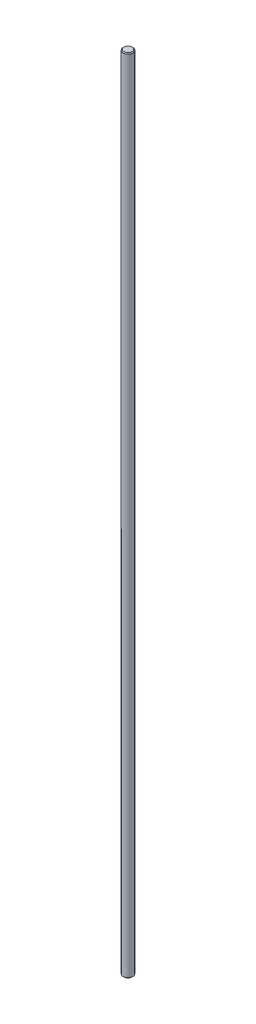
from build123d import *

# Parameters (mm, degrees)
ESQUISSE1_R      = 3
EXTRUSION1_DEPTH = 500
CHANFREIN1_SIZE  = 0.5


with BuildPart() as part:
    # Esquisse1 → Extrusion1 (new body)
    with BuildSketch(Plane(origin=(0, 0, 0), x_dir=(1, 0, 0), z_dir=(0, 1, 0))):
        with Locations(Location((0, 0, 0), (0, 0, 270))):
            Circle(ESQUISSE1_R)
    extrude(amount=EXTRUSION1_DEPTH)

    # Chanfrein1
    chanfrein1_edges = [part.edges().sort_by_distance(p)[0] for p in [
        (0, 0, -3),
        (0, 500, -3),
    ]]
    chamfer(chanfrein1_edges, length=CHANFREIN1_SIZE)


solid = part.part
